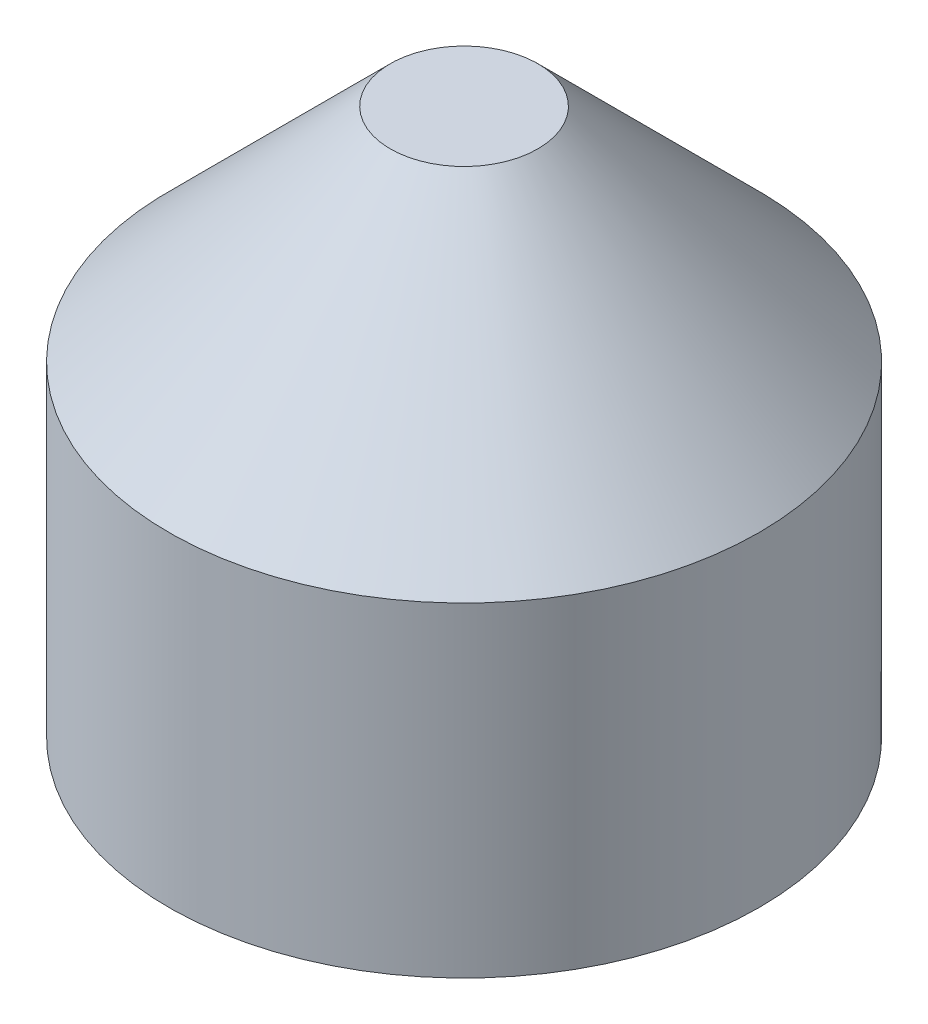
ISO-10303-21;
HEADER;
FILE_DESCRIPTION(('STEP AP214'),'2;1');
FILE_NAME('part.step','',(''),(''),'','','');
FILE_SCHEMA(('AUTOMOTIVE_DESIGN { 1 0 10303 214 1 1 1 1 }'));
ENDSEC;
DATA;
#1=APPLICATION_CONTEXT('core data for automotive mechanical design processes');
#2=APPLICATION_PROTOCOL_DEFINITION('international standard','automotive_design',2000,#1);
#3=PRODUCT_CONTEXT('',#1,'mechanical');
#4=PRODUCT('Part','Part','',(#3));
#5=PRODUCT_RELATED_PRODUCT_CATEGORY('part','',(#4));
#6=PRODUCT_DEFINITION_FORMATION('','',#4);
#7=PRODUCT_DEFINITION_CONTEXT('part definition',#1,'design');
#8=PRODUCT_DEFINITION('design','',#6,#7);
#9=PRODUCT_DEFINITION_SHAPE('','',#8);
#10=(LENGTH_UNIT() NAMED_UNIT(*) SI_UNIT(.MILLI.,.METRE.));
#11=(NAMED_UNIT(*) PLANE_ANGLE_UNIT() SI_UNIT($,.RADIAN.));
#12=(NAMED_UNIT(*) SI_UNIT($,.STERADIAN.) SOLID_ANGLE_UNIT());
#13=UNCERTAINTY_MEASURE_WITH_UNIT(LENGTH_MEASURE(1.E-05),#10,'distance_accuracy_value','');
#14=(GEOMETRIC_REPRESENTATION_CONTEXT(3) GLOBAL_UNCERTAINTY_ASSIGNED_CONTEXT((#13)) GLOBAL_UNIT_ASSIGNED_CONTEXT((#10,
#11,#12)) REPRESENTATION_CONTEXT('',''));
#15=CARTESIAN_POINT('',(0.,0.,0.));
#16=DIRECTION('',(0.,0.,1.));
#17=DIRECTION('',(1.,0.,0.));
#18=AXIS2_PLACEMENT_3D('',#15,#16,#17);
#19=CARTESIAN_POINT('',(1.076758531E-06,20.,6.50000000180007));
#20=DIRECTION('',(0.,1.,0.));
#21=DIRECTION('',(0.,0.,1.));
#22=AXIS2_PLACEMENT_3D('',#19,#20,#21);
#23=PLANE('',#22);
#24=DIRECTION('',(0.,0.,-1.));
#25=VECTOR('',#24,1.);
#26=CARTESIAN_POINT('',(2.00000107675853,20.,5.34529946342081));
#27=LINE('',#26,#25);
#28=CARTESIAN_POINT('',(2.00000107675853,20.,5.34529946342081));
#29=VERTEX_POINT('',#28);
#30=CARTESIAN_POINT('',(2.00000107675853,20.,7.65470054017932));
#31=VERTEX_POINT('',#30);
#32=EDGE_CURVE('E108',#29,#31,#27,.F.);
#33=ORIENTED_EDGE('',*,*,#32,.T.);
#34=DIRECTION('',(0.866025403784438,0.,-0.500000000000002));
#35=VECTOR('',#34,1.);
#36=CARTESIAN_POINT('',(2.00000107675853,20.,7.65470054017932));
#37=LINE('',#36,#35);
#38=CARTESIAN_POINT('',(1.07675853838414E-06,20.,8.80940107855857));
#39=VERTEX_POINT('',#38);
#40=EDGE_CURVE('E116',#31,#39,#37,.F.);
#41=ORIENTED_EDGE('',*,*,#40,.T.);
#42=DIRECTION('',(0.86602540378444,0.,0.499999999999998));
#43=VECTOR('',#42,1.);
#44=CARTESIAN_POINT('',(1.07675854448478E-06,20.,8.80940107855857));
#45=LINE('',#44,#43);
#46=CARTESIAN_POINT('',(-1.99999892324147,20.,7.65470054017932));
#47=VERTEX_POINT('',#46);
#48=EDGE_CURVE('E121',#39,#47,#45,.F.);
#49=ORIENTED_EDGE('',*,*,#48,.T.);
#50=DIRECTION('',(0.,0.,1.));
#51=VECTOR('',#50,1.);
#52=CARTESIAN_POINT('',(-1.99999892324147,20.,7.65470054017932));
#53=LINE('',#52,#51);
#54=CARTESIAN_POINT('',(-1.99999892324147,20.,5.34529946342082));
#55=VERTEX_POINT('',#54);
#56=EDGE_CURVE('E126',#47,#55,#53,.F.);
#57=ORIENTED_EDGE('',*,*,#56,.T.);
#58=DIRECTION('',(-0.866025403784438,0.,0.500000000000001));
#59=VECTOR('',#58,1.);
#60=CARTESIAN_POINT('',(-1.99999892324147,20.,5.34529946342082));
#61=LINE('',#60,#59);
#62=CARTESIAN_POINT('',(1.07675853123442E-06,20.,4.19059892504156));
#63=VERTEX_POINT('',#62);
#64=EDGE_CURVE('E131',#55,#63,#61,.F.);
#65=ORIENTED_EDGE('',*,*,#64,.T.);
#66=DIRECTION('',(-0.866025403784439,0.,-0.499999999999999));
#67=VECTOR('',#66,1.);
#68=CARTESIAN_POINT('',(1.07675853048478E-06,20.,4.19059892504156));
#69=LINE('',#68,#67);
#70=EDGE_CURVE('E136',#63,#29,#69,.F.);
#71=ORIENTED_EDGE('',*,*,#70,.T.);
#72=EDGE_LOOP('',(#33,#41,#49,#57,#65,#71));
#73=FACE_BOUND('',#72,.T.);
#74=ADVANCED_FACE('F15',(#73),#23,.F.);
#75=CARTESIAN_POINT('',(1.076758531E-06,15.,4.19059892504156));
#76=DIRECTION('',(0.499999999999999,0.,-0.866025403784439));
#77=DIRECTION('',(-0.866025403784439,0.,-0.499999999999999));
#78=AXIS2_PLACEMENT_3D('',#75,#76,#77);
#79=PLANE('',#78);
#80=DIRECTION('',(0.,1.,0.));
#81=VECTOR('',#80,1.);
#82=CARTESIAN_POINT('',(1.07675853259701E-06,15.,4.19059892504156));
#83=LINE('',#82,#81);
#84=CARTESIAN_POINT('',(1.07675853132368E-06,15.,4.19059892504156));
#85=VERTEX_POINT('',#84);
#86=EDGE_CURVE('E134',#63,#85,#83,.F.);
#87=ORIENTED_EDGE('',*,*,#86,.T.);
#88=DIRECTION('',(-0.866025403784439,0.,-0.5));
#89=VECTOR('',#88,1.);
#90=CARTESIAN_POINT('',(2.00000107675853,15.,5.34529946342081));
#91=LINE('',#90,#89);
#92=CARTESIAN_POINT('',(2.00000107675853,15.,5.34529946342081));
#93=VERTEX_POINT('',#92);
#94=EDGE_CURVE('E105',#93,#85,#91,.T.);
#95=ORIENTED_EDGE('',*,*,#94,.F.);
#96=DIRECTION('',(0.,1.,0.));
#97=VECTOR('',#96,1.);
#98=CARTESIAN_POINT('',(2.00000107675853,15.,5.34529946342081));
#99=LINE('',#98,#97);
#100=EDGE_CURVE('E111',#93,#29,#99,.T.);
#101=ORIENTED_EDGE('',*,*,#100,.T.);
#102=ORIENTED_EDGE('',*,*,#70,.F.);
#103=EDGE_LOOP('',(#87,#95,#101,#102));
#104=FACE_BOUND('',#103,.T.);
#105=ADVANCED_FACE('F143',(#104),#79,.F.);
#106=CARTESIAN_POINT('',(-1.99999892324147,15.,5.34529946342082));
#107=DIRECTION('',(-0.500000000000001,0.,-0.866025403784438));
#108=DIRECTION('',(-0.866025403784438,0.,0.500000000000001));
#109=AXIS2_PLACEMENT_3D('',#106,#107,#108);
#110=PLANE('',#109);
#111=DIRECTION('',(0.,1.,0.));
#112=VECTOR('',#111,1.);
#113=CARTESIAN_POINT('',(-1.99999892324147,15.,5.34529946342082));
#114=LINE('',#113,#112);
#115=CARTESIAN_POINT('',(-1.99999892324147,15.,5.34529946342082));
#116=VERTEX_POINT('',#115);
#117=EDGE_CURVE('E129',#55,#116,#114,.F.);
#118=ORIENTED_EDGE('',*,*,#117,.T.);
#119=DIRECTION('',(-0.866025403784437,0.,0.500000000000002));
#120=VECTOR('',#119,1.);
#121=CARTESIAN_POINT('',(1.07675853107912E-06,15.,4.19059892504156));
#122=LINE('',#121,#120);
#123=EDGE_CURVE('E102',#85,#116,#122,.T.);
#124=ORIENTED_EDGE('',*,*,#123,.F.);
#125=ORIENTED_EDGE('',*,*,#86,.F.);
#126=ORIENTED_EDGE('',*,*,#64,.F.);
#127=EDGE_LOOP('',(#118,#124,#125,#126));
#128=FACE_BOUND('',#127,.T.);
#129=ADVANCED_FACE('F161',(#128),#110,.F.);
#130=CARTESIAN_POINT('',(-1.99999892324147,15.,7.65470054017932));
#131=DIRECTION('',(-1.,0.,0.));
#132=DIRECTION('',(0.,0.,1.));
#133=AXIS2_PLACEMENT_3D('',#130,#131,#132);
#134=PLANE('',#133);
#135=DIRECTION('',(0.,1.,0.));
#136=VECTOR('',#135,1.);
#137=CARTESIAN_POINT('',(-1.99999892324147,15.,7.65470054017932));
#138=LINE('',#137,#136);
#139=CARTESIAN_POINT('',(-1.99999892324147,15.,7.65470054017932));
#140=VERTEX_POINT('',#139);
#141=EDGE_CURVE('E124',#47,#140,#138,.F.);
#142=ORIENTED_EDGE('',*,*,#141,.T.);
#143=DIRECTION('',(0.,0.,-1.));
#144=VECTOR('',#143,1.);
#145=CARTESIAN_POINT('',(-1.99999892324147,15.,6.50000000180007));
#146=LINE('',#145,#144);
#147=EDGE_CURVE('E99',#116,#140,#146,.F.);
#148=ORIENTED_EDGE('',*,*,#147,.F.);
#149=ORIENTED_EDGE('',*,*,#117,.F.);
#150=ORIENTED_EDGE('',*,*,#56,.F.);
#151=EDGE_LOOP('',(#142,#148,#149,#150));
#152=FACE_BOUND('',#151,.T.);
#153=ADVANCED_FACE('F158',(#152),#134,.F.);
#154=CARTESIAN_POINT('',(1.076758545E-06,15.,8.80940107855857));
#155=DIRECTION('',(-0.499999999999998,0.,0.86602540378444));
#156=DIRECTION('',(0.86602540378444,0.,0.499999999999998));
#157=AXIS2_PLACEMENT_3D('',#154,#155,#156);
#158=PLANE('',#157);
#159=DIRECTION('',(0.,1.,0.));
#160=VECTOR('',#159,1.);
#161=CARTESIAN_POINT('',(1.07675853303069E-06,15.,8.80940107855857));
#162=LINE('',#161,#160);
#163=CARTESIAN_POINT('',(1.07675854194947E-06,15.,8.80940107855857));
#164=VERTEX_POINT('',#163);
#165=EDGE_CURVE('E119',#39,#164,#162,.F.);
#166=ORIENTED_EDGE('',*,*,#165,.T.);
#167=DIRECTION('',(0.86602540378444,0.,0.499999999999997));
#168=VECTOR('',#167,1.);
#169=CARTESIAN_POINT('',(-1.99999892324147,15.,7.65470054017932));
#170=LINE('',#169,#168);
#171=EDGE_CURVE('E96',#140,#164,#170,.T.);
#172=ORIENTED_EDGE('',*,*,#171,.F.);
#173=ORIENTED_EDGE('',*,*,#141,.F.);
#174=ORIENTED_EDGE('',*,*,#48,.F.);
#175=EDGE_LOOP('',(#166,#172,#173,#174));
#176=FACE_BOUND('',#175,.T.);
#177=ADVANCED_FACE('F155',(#176),#158,.F.);
#178=CARTESIAN_POINT('',(2.00000107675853,15.,7.65470054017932));
#179=DIRECTION('',(0.500000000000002,0.,0.866025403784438));
#180=DIRECTION('',(0.866025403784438,0.,-0.500000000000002));
#181=AXIS2_PLACEMENT_3D('',#178,#179,#180);
#182=PLANE('',#181);
#183=DIRECTION('',(0.,1.,0.));
#184=VECTOR('',#183,1.);
#185=CARTESIAN_POINT('',(2.00000107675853,15.,7.65470054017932));
#186=LINE('',#185,#184);
#187=CARTESIAN_POINT('',(2.00000107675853,15.,7.65470054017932));
#188=VERTEX_POINT('',#187);
#189=EDGE_CURVE('E114',#31,#188,#186,.F.);
#190=ORIENTED_EDGE('',*,*,#189,.T.);
#191=DIRECTION('',(0.866025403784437,0.,-0.500000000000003));
#192=VECTOR('',#191,1.);
#193=CARTESIAN_POINT('',(1.07675854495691E-06,15.,8.80940107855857));
#194=LINE('',#193,#192);
#195=EDGE_CURVE('E93',#164,#188,#194,.T.);
#196=ORIENTED_EDGE('',*,*,#195,.F.);
#197=ORIENTED_EDGE('',*,*,#165,.F.);
#198=ORIENTED_EDGE('',*,*,#40,.F.);
#199=EDGE_LOOP('',(#190,#196,#197,#198));
#200=FACE_BOUND('',#199,.T.);
#201=ADVANCED_FACE('F149',(#200),#182,.F.);
#202=CARTESIAN_POINT('',(2.00000107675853,15.,5.34529946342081));
#203=DIRECTION('',(1.,0.,0.));
#204=DIRECTION('',(0.,0.,-1.));
#205=AXIS2_PLACEMENT_3D('',#202,#203,#204);
#206=PLANE('',#205);
#207=ORIENTED_EDGE('',*,*,#100,.F.);
#208=DIRECTION('',(0.,0.,-1.));
#209=VECTOR('',#208,1.);
#210=CARTESIAN_POINT('',(2.00000107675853,15.,6.50000000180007));
#211=LINE('',#210,#209);
#212=EDGE_CURVE('E90',#188,#93,#211,.T.);
#213=ORIENTED_EDGE('',*,*,#212,.F.);
#214=ORIENTED_EDGE('',*,*,#189,.F.);
#215=ORIENTED_EDGE('',*,*,#32,.F.);
#216=EDGE_LOOP('',(#207,#213,#214,#215));
#217=FACE_BOUND('',#216,.T.);
#218=ADVANCED_FACE('F146',(#217),#206,.F.);
#219=CARTESIAN_POINT('',(-0.499998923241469,23.,6.50000000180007));
#220=DIRECTION('',(0.,1.,0.));
#221=DIRECTION('',(0.,0.,1.));
#222=AXIS2_PLACEMENT_3D('',#219,#220,#221);
#223=PLANE('',#222);
#224=CARTESIAN_POINT('',(1.07675853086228E-06,23.000000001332,6.50000000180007));
#225=DIRECTION('',(0.,-1.,0.));
#226=DIRECTION('',(0.,0.,-1.));
#227=AXIS2_PLACEMENT_3D('',#224,#225,#226);
#228=CIRCLE('',#227,1.00000000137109);
#229=CARTESIAN_POINT('',(1.00000107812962,23.000000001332,6.50000000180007));
#230=VERTEX_POINT('',#229);
#231=EDGE_CURVE('E18',#230,#230,#228,.T.);
#232=ORIENTED_EDGE('',*,*,#231,.F.);
#233=EDGE_LOOP('',(#232));
#234=FACE_BOUND('',#233,.T.);
#235=ADVANCED_FACE('F166',(#234),#223,.T.);
#236=CARTESIAN_POINT('',(-1.48038368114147,15.,6.50000000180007));
#237=DIRECTION('',(0.,-1.,0.));
#238=DIRECTION('',(0.,0.,-1.));
#239=AXIS2_PLACEMENT_3D('',#236,#237,#238);
#240=PLANE('',#239);
#241=ORIENTED_EDGE('',*,*,#195,.T.);
#242=ORIENTED_EDGE('',*,*,#212,.T.);
#243=ORIENTED_EDGE('',*,*,#94,.T.);
#244=ORIENTED_EDGE('',*,*,#123,.T.);
#245=ORIENTED_EDGE('',*,*,#147,.T.);
#246=ORIENTED_EDGE('',*,*,#171,.T.);
#247=EDGE_LOOP('',(#241,#242,#243,#244,#245,#246));
#248=FACE_BOUND('',#247,.T.);
#249=CARTESIAN_POINT('',(1.07675853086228E-06,14.9999999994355,6.50000000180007));
#250=DIRECTION('',(0.,1.,0.));
#251=DIRECTION('',(0.,0.,1.));
#252=AXIS2_PLACEMENT_3D('',#249,#250,#251);
#253=CIRCLE('',#252,2.96076951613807);
#254=CARTESIAN_POINT('',(2.9607705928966,14.9999999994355,6.50000000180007));
#255=VERTEX_POINT('',#254);
#256=EDGE_CURVE('E33',#255,#255,#253,.T.);
#257=ORIENTED_EDGE('',*,*,#256,.F.);
#258=EDGE_LOOP('',(#257));
#259=FACE_BOUND('',#258,.T.);
#260=ADVANCED_FACE('F163',(#248,#259),#240,.T.);
#261=CARTESIAN_POINT('',(1.07675853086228E-06,19.9999999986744,6.50000000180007));
#262=DIRECTION('',(0.,-1.,0.));
#263=DIRECTION('',(0.,0.,-1.));
#264=AXIS2_PLACEMENT_3D('',#261,#262,#263);
#265=CONICAL_SURFACE('',#264,3.99999999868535,0.785398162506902);
#266=CARTESIAN_POINT('',(1.076758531E-06,20.,6.50000000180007));
#267=DIRECTION('',(0.,-1.,0.));
#268=DIRECTION('',(0.,0.,-1.));
#269=AXIS2_PLACEMENT_3D('',#266,#267,#268);
#270=CIRCLE('',#269,4.);
#271=CARTESIAN_POINT('',(4.00000107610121,19.9999999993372,6.50000000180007));
#272=VERTEX_POINT('',#271);
#273=EDGE_CURVE('E23',#272,#272,#270,.T.);
#274=ORIENTED_EDGE('',*,*,#273,.F.);
#275=EDGE_LOOP('',(#274));
#276=FACE_BOUND('',#275,.T.);
#277=ORIENTED_EDGE('',*,*,#231,.T.);
#278=EDGE_LOOP('',(#277));
#279=FACE_BOUND('',#278,.T.);
#280=ADVANCED_FACE('F165',(#276,#279),#265,.T.);
#281=CARTESIAN_POINT('',(1.07675853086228E-06,15.6000000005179,6.50000000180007));
#282=DIRECTION('',(0.,1.,0.));
#283=DIRECTION('',(0.,0.,1.));
#284=AXIS2_PLACEMENT_3D('',#281,#282,#283);
#285=CONICAL_SURFACE('',#284,3.99999999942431,1.04719754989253);
#286=ORIENTED_EDGE('',*,*,#256,.T.);
#287=EDGE_LOOP('',(#286));
#288=FACE_BOUND('',#287,.T.);
#289=CARTESIAN_POINT('',(1.076758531E-06,15.6,6.50000000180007));
#290=DIRECTION('',(0.,-1.,0.));
#291=DIRECTION('',(0.,0.,-1.));
#292=AXIS2_PLACEMENT_3D('',#289,#290,#291);
#293=CIRCLE('',#292,4.);
#294=CARTESIAN_POINT('',(4.00000107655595,15.6000000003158,6.50000000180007));
#295=VERTEX_POINT('',#294);
#296=EDGE_CURVE('E10',#295,#295,#293,.F.);
#297=ORIENTED_EDGE('',*,*,#296,.F.);
#298=EDGE_LOOP('',(#297));
#299=FACE_BOUND('',#298,.T.);
#300=ADVANCED_FACE('F76',(#288,#299),#285,.T.);
#301=CARTESIAN_POINT('',(1.076758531E-06,17.8,6.50000000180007));
#302=DIRECTION('',(0.,-1.,0.));
#303=DIRECTION('',(0.,0.,-1.));
#304=AXIS2_PLACEMENT_3D('',#301,#302,#303);
#305=CYLINDRICAL_SURFACE('',#304,4.);
#306=ORIENTED_EDGE('',*,*,#296,.T.);
#307=EDGE_LOOP('',(#306));
#308=FACE_BOUND('',#307,.T.);
#309=ORIENTED_EDGE('',*,*,#273,.T.);
#310=EDGE_LOOP('',(#309));
#311=FACE_BOUND('',#310,.T.);
#312=ADVANCED_FACE('F78',(#308,#311),#305,.T.);
#313=CLOSED_SHELL('',(#74,#105,#129,#153,#177,#201,#218,#235,#260,#280,#300,#312));
#314=MANIFOLD_SOLID_BREP('B1',#313);
#315=ADVANCED_BREP_SHAPE_REPRESENTATION('',(#18,#314),#14);
#316=SHAPE_DEFINITION_REPRESENTATION(#9,#315);
ENDSEC;
END-ISO-10303-21;
